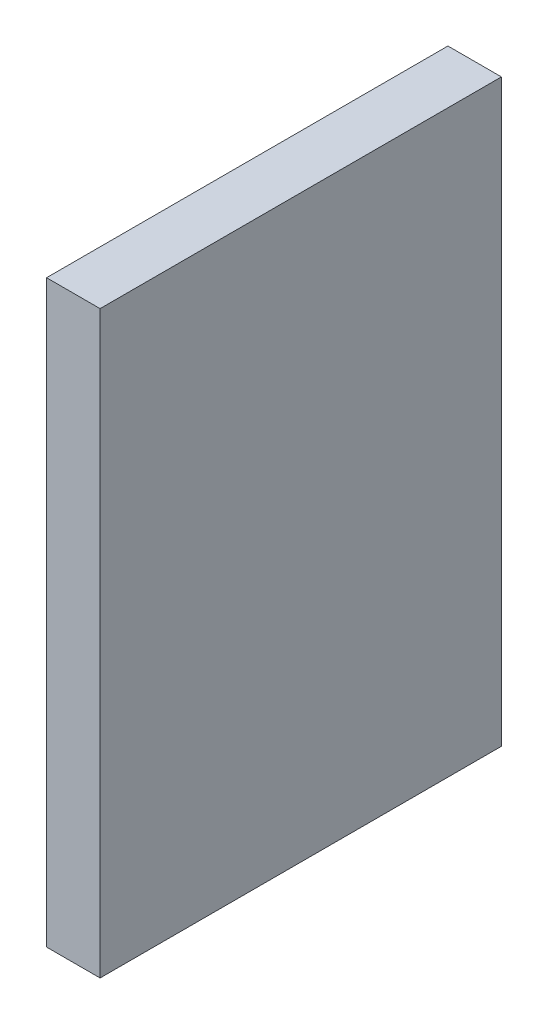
ISO-10303-21;
HEADER;
FILE_DESCRIPTION(('STEP AP214'),'2;1');
FILE_NAME('part.step','',(''),(''),'','','');
FILE_SCHEMA(('AUTOMOTIVE_DESIGN { 1 0 10303 214 1 1 1 1 }'));
ENDSEC;
DATA;
#1=APPLICATION_CONTEXT('core data for automotive mechanical design processes');
#2=APPLICATION_PROTOCOL_DEFINITION('international standard','automotive_design',2000,#1);
#3=PRODUCT_CONTEXT('',#1,'mechanical');
#4=PRODUCT('Part','Part','',(#3));
#5=PRODUCT_RELATED_PRODUCT_CATEGORY('part','',(#4));
#6=PRODUCT_DEFINITION_FORMATION('','',#4);
#7=PRODUCT_DEFINITION_CONTEXT('part definition',#1,'design');
#8=PRODUCT_DEFINITION('design','',#6,#7);
#9=PRODUCT_DEFINITION_SHAPE('','',#8);
#10=(LENGTH_UNIT() NAMED_UNIT(*) SI_UNIT(.MILLI.,.METRE.));
#11=(NAMED_UNIT(*) PLANE_ANGLE_UNIT() SI_UNIT($,.RADIAN.));
#12=(NAMED_UNIT(*) SI_UNIT($,.STERADIAN.) SOLID_ANGLE_UNIT());
#13=UNCERTAINTY_MEASURE_WITH_UNIT(LENGTH_MEASURE(1.E-05),#10,'distance_accuracy_value','');
#14=(GEOMETRIC_REPRESENTATION_CONTEXT(3) GLOBAL_UNCERTAINTY_ASSIGNED_CONTEXT((#13)) GLOBAL_UNIT_ASSIGNED_CONTEXT((#10,
#11,#12)) REPRESENTATION_CONTEXT('',''));
#15=CARTESIAN_POINT('',(0.,0.,0.));
#16=DIRECTION('',(0.,0.,1.));
#17=DIRECTION('',(1.,0.,0.));
#18=AXIS2_PLACEMENT_3D('',#15,#16,#17);
#19=CARTESIAN_POINT('',(0.,0.,90.));
#20=DIRECTION('',(1.,0.,0.));
#21=DIRECTION('',(0.,0.,-1.));
#22=AXIS2_PLACEMENT_3D('',#19,#20,#21);
#23=PLANE('',#22);
#24=DIRECTION('',(0.,-1.,0.));
#25=VECTOR('',#24,1.);
#26=CARTESIAN_POINT('',(0.,0.,0.));
#27=LINE('',#26,#25);
#28=CARTESIAN_POINT('',(0.,130.,0.));
#29=VERTEX_POINT('',#28);
#30=CARTESIAN_POINT('',(0.,0.,0.));
#31=VERTEX_POINT('',#30);
#32=EDGE_CURVE('E74',#29,#31,#27,.T.);
#33=ORIENTED_EDGE('',*,*,#32,.T.);
#34=DIRECTION('',(0.,0.,-1.));
#35=VECTOR('',#34,1.);
#36=CARTESIAN_POINT('',(0.,0.,90.));
#37=LINE('',#36,#35);
#38=CARTESIAN_POINT('',(0.,0.,90.));
#39=VERTEX_POINT('',#38);
#40=EDGE_CURVE('E11',#39,#31,#37,.T.);
#41=ORIENTED_EDGE('',*,*,#40,.F.);
#42=DIRECTION('',(0.,-1.,0.));
#43=VECTOR('',#42,1.);
#44=CARTESIAN_POINT('',(0.,0.,90.));
#45=LINE('',#44,#43);
#46=CARTESIAN_POINT('',(0.,130.,90.));
#47=VERTEX_POINT('',#46);
#48=EDGE_CURVE('E92',#47,#39,#45,.T.);
#49=ORIENTED_EDGE('',*,*,#48,.F.);
#50=DIRECTION('',(0.,0.,-1.));
#51=VECTOR('',#50,1.);
#52=CARTESIAN_POINT('',(0.,130.,90.));
#53=LINE('',#52,#51);
#54=EDGE_CURVE('E86',#47,#29,#53,.T.);
#55=ORIENTED_EDGE('',*,*,#54,.T.);
#56=EDGE_LOOP('',(#33,#41,#49,#55));
#57=FACE_BOUND('',#56,.T.);
#58=ADVANCED_FACE('F30',(#57),#23,.F.);
#59=CARTESIAN_POINT('',(0.,0.,90.));
#60=DIRECTION('',(0.,1.,0.));
#61=DIRECTION('',(0.,0.,1.));
#62=AXIS2_PLACEMENT_3D('',#59,#60,#61);
#63=PLANE('',#62);
#64=DIRECTION('',(1.,0.,0.));
#65=VECTOR('',#64,1.);
#66=CARTESIAN_POINT('',(0.,0.,0.));
#67=LINE('',#66,#65);
#68=CARTESIAN_POINT('',(12.,0.,0.));
#69=VERTEX_POINT('',#68);
#70=EDGE_CURVE('E70',#31,#69,#67,.T.);
#71=ORIENTED_EDGE('',*,*,#70,.T.);
#72=DIRECTION('',(0.,0.,-1.));
#73=VECTOR('',#72,1.);
#74=CARTESIAN_POINT('',(12.,0.,90.));
#75=LINE('',#74,#73);
#76=CARTESIAN_POINT('',(12.,0.,90.));
#77=VERTEX_POINT('',#76);
#78=EDGE_CURVE('E37',#77,#69,#75,.T.);
#79=ORIENTED_EDGE('',*,*,#78,.F.);
#80=DIRECTION('',(1.,0.,0.));
#81=VECTOR('',#80,1.);
#82=CARTESIAN_POINT('',(0.,0.,90.));
#83=LINE('',#82,#81);
#84=EDGE_CURVE('E82',#39,#77,#83,.T.);
#85=ORIENTED_EDGE('',*,*,#84,.F.);
#86=ORIENTED_EDGE('',*,*,#40,.T.);
#87=EDGE_LOOP('',(#71,#79,#85,#86));
#88=FACE_BOUND('',#87,.T.);
#89=ADVANCED_FACE('F81',(#88),#63,.F.);
#90=CARTESIAN_POINT('',(12.,0.,90.));
#91=DIRECTION('',(-1.,0.,0.));
#92=DIRECTION('',(0.,0.,1.));
#93=AXIS2_PLACEMENT_3D('',#90,#91,#92);
#94=PLANE('',#93);
#95=DIRECTION('',(0.,1.,0.));
#96=VECTOR('',#95,1.);
#97=CARTESIAN_POINT('',(12.,0.,0.));
#98=LINE('',#97,#96);
#99=CARTESIAN_POINT('',(12.,130.,0.));
#100=VERTEX_POINT('',#99);
#101=EDGE_CURVE('E75',#69,#100,#98,.T.);
#102=ORIENTED_EDGE('',*,*,#101,.T.);
#103=DIRECTION('',(0.,0.,-1.));
#104=VECTOR('',#103,1.);
#105=CARTESIAN_POINT('',(12.,130.,90.));
#106=LINE('',#105,#104);
#107=CARTESIAN_POINT('',(12.,130.,90.));
#108=VERTEX_POINT('',#107);
#109=EDGE_CURVE('E98',#108,#100,#106,.T.);
#110=ORIENTED_EDGE('',*,*,#109,.F.);
#111=DIRECTION('',(0.,1.,0.));
#112=VECTOR('',#111,1.);
#113=CARTESIAN_POINT('',(12.,0.,90.));
#114=LINE('',#113,#112);
#115=EDGE_CURVE('E49',#77,#108,#114,.T.);
#116=ORIENTED_EDGE('',*,*,#115,.F.);
#117=ORIENTED_EDGE('',*,*,#78,.T.);
#118=EDGE_LOOP('',(#102,#110,#116,#117));
#119=FACE_BOUND('',#118,.T.);
#120=ADVANCED_FACE('F101',(#119),#94,.F.);
#121=CARTESIAN_POINT('',(0.,130.,90.));
#122=DIRECTION('',(0.,-1.,0.));
#123=DIRECTION('',(0.,0.,-1.));
#124=AXIS2_PLACEMENT_3D('',#121,#122,#123);
#125=PLANE('',#124);
#126=DIRECTION('',(-1.,0.,0.));
#127=VECTOR('',#126,1.);
#128=CARTESIAN_POINT('',(0.,130.,0.));
#129=LINE('',#128,#127);
#130=EDGE_CURVE('E90',#100,#29,#129,.T.);
#131=ORIENTED_EDGE('',*,*,#130,.T.);
#132=ORIENTED_EDGE('',*,*,#54,.F.);
#133=DIRECTION('',(-1.,0.,0.));
#134=VECTOR('',#133,1.);
#135=CARTESIAN_POINT('',(0.,130.,90.));
#136=LINE('',#135,#134);
#137=EDGE_CURVE('E44',#108,#47,#136,.T.);
#138=ORIENTED_EDGE('',*,*,#137,.F.);
#139=ORIENTED_EDGE('',*,*,#109,.T.);
#140=EDGE_LOOP('',(#131,#132,#138,#139));
#141=FACE_BOUND('',#140,.T.);
#142=ADVANCED_FACE('F103',(#141),#125,.F.);
#143=CARTESIAN_POINT('',(0.,130.,90.));
#144=DIRECTION('',(0.,0.,-1.));
#145=DIRECTION('',(-1.,0.,0.));
#146=AXIS2_PLACEMENT_3D('',#143,#144,#145);
#147=PLANE('',#146);
#148=ORIENTED_EDGE('',*,*,#48,.T.);
#149=ORIENTED_EDGE('',*,*,#84,.T.);
#150=ORIENTED_EDGE('',*,*,#115,.T.);
#151=ORIENTED_EDGE('',*,*,#137,.T.);
#152=EDGE_LOOP('',(#148,#149,#150,#151));
#153=FACE_BOUND('',#152,.T.);
#154=ADVANCED_FACE('F104',(#153),#147,.F.);
#155=CARTESIAN_POINT('',(0.,130.,0.));
#156=DIRECTION('',(0.,0.,-1.));
#157=DIRECTION('',(-1.,0.,0.));
#158=AXIS2_PLACEMENT_3D('',#155,#156,#157);
#159=PLANE('',#158);
#160=ORIENTED_EDGE('',*,*,#32,.F.);
#161=ORIENTED_EDGE('',*,*,#130,.F.);
#162=ORIENTED_EDGE('',*,*,#101,.F.);
#163=ORIENTED_EDGE('',*,*,#70,.F.);
#164=EDGE_LOOP('',(#160,#161,#162,#163));
#165=FACE_BOUND('',#164,.T.);
#166=ADVANCED_FACE('F71',(#165),#159,.T.);
#167=CLOSED_SHELL('',(#58,#89,#120,#142,#154,#166));
#168=MANIFOLD_SOLID_BREP('B2',#167);
#169=ADVANCED_BREP_SHAPE_REPRESENTATION('',(#18,#168),#14);
#170=SHAPE_DEFINITION_REPRESENTATION(#9,#169);
ENDSEC;
END-ISO-10303-21;
